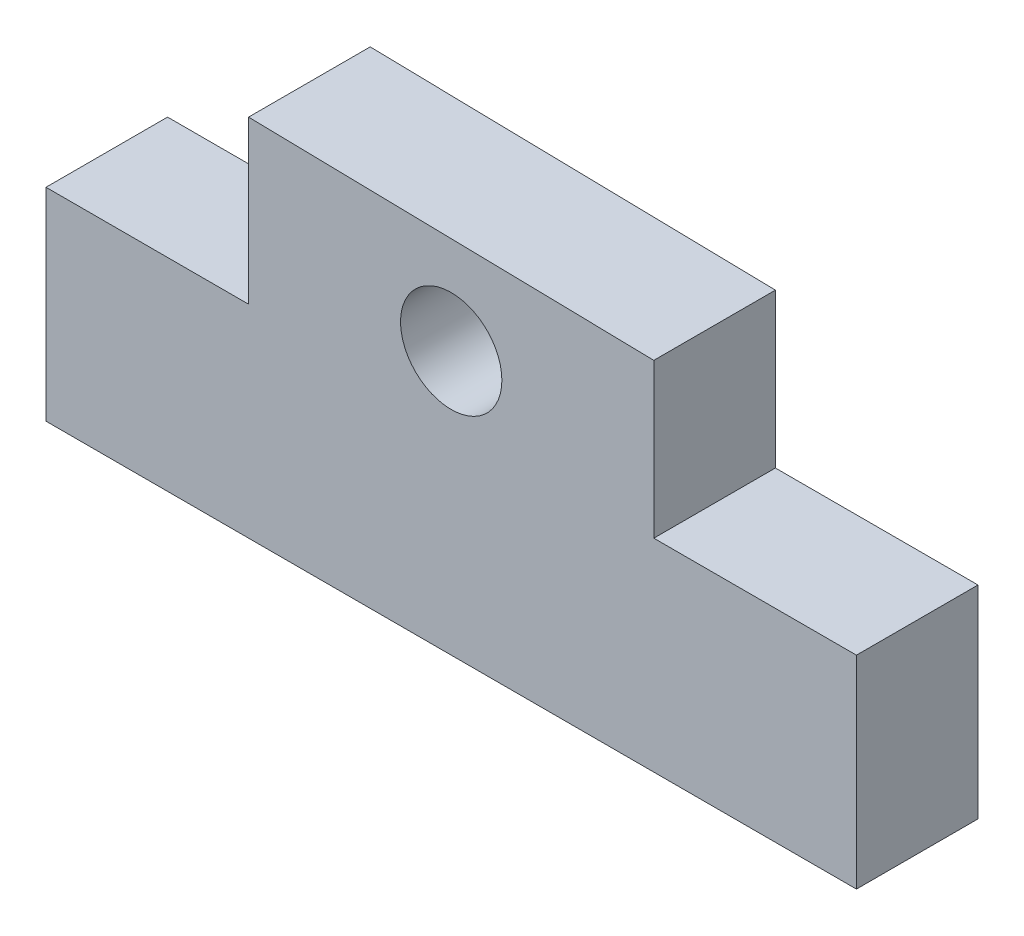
ISO-10303-21;
HEADER;
FILE_DESCRIPTION(('STEP AP214'),'2;1');
FILE_NAME('part.step','',(''),(''),'','','');
FILE_SCHEMA(('AUTOMOTIVE_DESIGN { 1 0 10303 214 1 1 1 1 }'));
ENDSEC;
DATA;
#1=APPLICATION_CONTEXT('core data for automotive mechanical design processes');
#2=APPLICATION_PROTOCOL_DEFINITION('international standard','automotive_design',2000,#1);
#3=PRODUCT_CONTEXT('',#1,'mechanical');
#4=PRODUCT('Part','Part','',(#3));
#5=PRODUCT_RELATED_PRODUCT_CATEGORY('part','',(#4));
#6=PRODUCT_DEFINITION_FORMATION('','',#4);
#7=PRODUCT_DEFINITION_CONTEXT('part definition',#1,'design');
#8=PRODUCT_DEFINITION('design','',#6,#7);
#9=PRODUCT_DEFINITION_SHAPE('','',#8);
#10=(LENGTH_UNIT() NAMED_UNIT(*) SI_UNIT(.MILLI.,.METRE.));
#11=(NAMED_UNIT(*) PLANE_ANGLE_UNIT() SI_UNIT($,.RADIAN.));
#12=(NAMED_UNIT(*) SI_UNIT($,.STERADIAN.) SOLID_ANGLE_UNIT());
#13=UNCERTAINTY_MEASURE_WITH_UNIT(LENGTH_MEASURE(1.E-05),#10,'distance_accuracy_value','');
#14=(GEOMETRIC_REPRESENTATION_CONTEXT(3) GLOBAL_UNCERTAINTY_ASSIGNED_CONTEXT((#13)) GLOBAL_UNIT_ASSIGNED_CONTEXT((#10,
#11,#12)) REPRESENTATION_CONTEXT('',''));
#15=CARTESIAN_POINT('',(0.,0.,0.));
#16=DIRECTION('',(0.,0.,1.));
#17=DIRECTION('',(1.,0.,0.));
#18=AXIS2_PLACEMENT_3D('',#15,#16,#17);
#19=CARTESIAN_POINT('',(5.72225175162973E-12,257.707308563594,3.));
#20=DIRECTION('',(0.,1.,0.));
#21=DIRECTION('',(-1.,0.,0.));
#22=AXIS2_PLACEMENT_3D('',#19,#20,#21);
#23=PLANE('',#22);
#24=DIRECTION('',(1.,0.,0.));
#25=VECTOR('',#24,1.);
#26=CARTESIAN_POINT('',(5.72225175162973E-12,257.707308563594,0.));
#27=LINE('',#26,#25);
#28=CARTESIAN_POINT('',(60.3873488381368,257.707308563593,0.));
#29=VERTEX_POINT('',#28);
#30=CARTESIAN_POINT('',(65.3873488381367,257.707308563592,0.));
#31=VERTEX_POINT('',#30);
#32=EDGE_CURVE('E129',#29,#31,#27,.T.);
#33=ORIENTED_EDGE('',*,*,#32,.F.);
#34=DIRECTION('',(0.,0.,-1.));
#35=VECTOR('',#34,1.);
#36=CARTESIAN_POINT('',(60.3873488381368,257.707308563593,3.));
#37=LINE('',#36,#35);
#38=CARTESIAN_POINT('',(60.3873488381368,257.707308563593,3.));
#39=VERTEX_POINT('',#38);
#40=EDGE_CURVE('E11',#39,#29,#37,.T.);
#41=ORIENTED_EDGE('',*,*,#40,.F.);
#42=DIRECTION('',(1.,0.,0.));
#43=VECTOR('',#42,1.);
#44=CARTESIAN_POINT('',(5.72225175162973E-12,257.707308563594,3.));
#45=LINE('',#44,#43);
#46=CARTESIAN_POINT('',(65.3873488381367,257.707308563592,3.));
#47=VERTEX_POINT('',#46);
#48=EDGE_CURVE('E178',#39,#47,#45,.T.);
#49=ORIENTED_EDGE('',*,*,#48,.T.);
#50=DIRECTION('',(0.,0.,-1.));
#51=VECTOR('',#50,1.);
#52=CARTESIAN_POINT('',(65.3873488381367,257.707308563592,3.));
#53=LINE('',#52,#51);
#54=EDGE_CURVE('E83',#47,#31,#53,.T.);
#55=ORIENTED_EDGE('',*,*,#54,.T.);
#56=EDGE_LOOP('',(#33,#41,#49,#55));
#57=FACE_BOUND('',#56,.T.);
#58=ADVANCED_FACE('F32',(#57),#23,.T.);
#59=CARTESIAN_POINT('',(60.3873488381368,0.,3.));
#60=DIRECTION('',(1.,0.,0.));
#61=DIRECTION('',(0.,0.,-1.));
#62=AXIS2_PLACEMENT_3D('',#59,#60,#61);
#63=PLANE('',#62);
#64=DIRECTION('',(0.,-1.,0.));
#65=VECTOR('',#64,1.);
#66=CARTESIAN_POINT('',(60.3873488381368,0.,0.));
#67=LINE('',#66,#65);
#68=CARTESIAN_POINT('',(60.3873488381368,261.508801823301,0.));
#69=VERTEX_POINT('',#68);
#70=EDGE_CURVE('E132',#69,#29,#67,.T.);
#71=ORIENTED_EDGE('',*,*,#70,.F.);
#72=DIRECTION('',(0.,0.,-1.));
#73=VECTOR('',#72,1.);
#74=CARTESIAN_POINT('',(60.3873488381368,261.508801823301,3.));
#75=LINE('',#74,#73);
#76=CARTESIAN_POINT('',(60.3873488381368,261.508801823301,3.));
#77=VERTEX_POINT('',#76);
#78=EDGE_CURVE('E41',#77,#69,#75,.T.);
#79=ORIENTED_EDGE('',*,*,#78,.F.);
#80=DIRECTION('',(0.,-1.,0.));
#81=VECTOR('',#80,1.);
#82=CARTESIAN_POINT('',(60.3873488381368,0.,3.));
#83=LINE('',#82,#81);
#84=EDGE_CURVE('E175',#77,#39,#83,.T.);
#85=ORIENTED_EDGE('',*,*,#84,.T.);
#86=ORIENTED_EDGE('',*,*,#40,.T.);
#87=EDGE_LOOP('',(#71,#79,#85,#86));
#88=FACE_BOUND('',#87,.T.);
#89=ADVANCED_FACE('F166',(#88),#63,.T.);
#90=CARTESIAN_POINT('',(5.21286744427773,262.604052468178,3.));
#91=DIRECTION('',(0.0198467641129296,0.999803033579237,0.));
#92=DIRECTION('',(-0.999803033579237,0.0198467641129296,0.));
#93=AXIS2_PLACEMENT_3D('',#90,#91,#92);
#94=PLANE('',#93);
#95=DIRECTION('',(0.999803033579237,-0.0198467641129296,0.));
#96=VECTOR('',#95,1.);
#97=CARTESIAN_POINT('',(5.21286744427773,262.604052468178,0.));
#98=LINE('',#97,#96);
#99=CARTESIAN_POINT('',(50.3873488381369,261.707308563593,0.));
#100=VERTEX_POINT('',#99);
#101=EDGE_CURVE('E135',#100,#69,#98,.T.);
#102=ORIENTED_EDGE('',*,*,#101,.F.);
#103=DIRECTION('',(0.,0.,-1.));
#104=VECTOR('',#103,1.);
#105=CARTESIAN_POINT('',(50.3873488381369,261.707308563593,3.));
#106=LINE('',#105,#104);
#107=CARTESIAN_POINT('',(50.3873488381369,261.707308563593,3.));
#108=VERTEX_POINT('',#107);
#109=EDGE_CURVE('E155',#108,#100,#106,.T.);
#110=ORIENTED_EDGE('',*,*,#109,.F.);
#111=DIRECTION('',(0.999803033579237,-0.0198467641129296,0.));
#112=VECTOR('',#111,1.);
#113=CARTESIAN_POINT('',(5.21286744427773,262.604052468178,3.));
#114=LINE('',#113,#112);
#115=EDGE_CURVE('E162',#108,#77,#114,.T.);
#116=ORIENTED_EDGE('',*,*,#115,.T.);
#117=ORIENTED_EDGE('',*,*,#78,.T.);
#118=EDGE_LOOP('',(#102,#110,#116,#117));
#119=FACE_BOUND('',#118,.T.);
#120=ADVANCED_FACE('F160',(#119),#94,.T.);
#121=CARTESIAN_POINT('',(50.3873488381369,0.,3.));
#122=DIRECTION('',(-1.,0.,0.));
#123=DIRECTION('',(0.,0.,1.));
#124=AXIS2_PLACEMENT_3D('',#121,#122,#123);
#125=PLANE('',#124);
#126=DIRECTION('',(0.,1.,0.));
#127=VECTOR('',#126,1.);
#128=CARTESIAN_POINT('',(50.3873488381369,0.,0.));
#129=LINE('',#128,#127);
#130=CARTESIAN_POINT('',(50.3873488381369,257.707308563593,0.));
#131=VERTEX_POINT('',#130);
#132=EDGE_CURVE('E138',#131,#100,#129,.T.);
#133=ORIENTED_EDGE('',*,*,#132,.F.);
#134=DIRECTION('',(0.,0.,-1.));
#135=VECTOR('',#134,1.);
#136=CARTESIAN_POINT('',(50.3873488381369,257.707308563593,3.));
#137=LINE('',#136,#135);
#138=CARTESIAN_POINT('',(50.3873488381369,257.707308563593,3.));
#139=VERTEX_POINT('',#138);
#140=EDGE_CURVE('E153',#139,#131,#137,.T.);
#141=ORIENTED_EDGE('',*,*,#140,.F.);
#142=DIRECTION('',(0.,1.,0.));
#143=VECTOR('',#142,1.);
#144=CARTESIAN_POINT('',(50.3873488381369,0.,3.));
#145=LINE('',#144,#143);
#146=EDGE_CURVE('E174',#139,#108,#145,.T.);
#147=ORIENTED_EDGE('',*,*,#146,.T.);
#148=ORIENTED_EDGE('',*,*,#109,.T.);
#149=EDGE_LOOP('',(#133,#141,#147,#148));
#150=FACE_BOUND('',#149,.T.);
#151=ADVANCED_FACE('F172',(#150),#125,.T.);
#152=CARTESIAN_POINT('',(0.,257.707308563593,3.));
#153=DIRECTION('',(0.,1.,0.));
#154=DIRECTION('',(0.,0.,1.));
#155=AXIS2_PLACEMENT_3D('',#152,#153,#154);
#156=PLANE('',#155);
#157=DIRECTION('',(1.,0.,0.));
#158=VECTOR('',#157,1.);
#159=CARTESIAN_POINT('',(0.,257.707308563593,0.));
#160=LINE('',#159,#158);
#161=CARTESIAN_POINT('',(45.3873488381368,257.707308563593,0.));
#162=VERTEX_POINT('',#161);
#163=EDGE_CURVE('E141',#162,#131,#160,.T.);
#164=ORIENTED_EDGE('',*,*,#163,.F.);
#165=DIRECTION('',(0.,0.,-1.));
#166=VECTOR('',#165,1.);
#167=CARTESIAN_POINT('',(45.3873488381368,257.707308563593,3.));
#168=LINE('',#167,#166);
#169=CARTESIAN_POINT('',(45.3873488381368,257.707308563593,3.));
#170=VERTEX_POINT('',#169);
#171=EDGE_CURVE('E112',#170,#162,#168,.T.);
#172=ORIENTED_EDGE('',*,*,#171,.F.);
#173=DIRECTION('',(1.,0.,0.));
#174=VECTOR('',#173,1.);
#175=CARTESIAN_POINT('',(0.,257.707308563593,3.));
#176=LINE('',#175,#174);
#177=EDGE_CURVE('E119',#170,#139,#176,.T.);
#178=ORIENTED_EDGE('',*,*,#177,.T.);
#179=ORIENTED_EDGE('',*,*,#140,.T.);
#180=EDGE_LOOP('',(#164,#172,#178,#179));
#181=FACE_BOUND('',#180,.T.);
#182=ADVANCED_FACE('F182',(#181),#156,.T.);
#183=CARTESIAN_POINT('',(45.3873488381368,0.,3.));
#184=DIRECTION('',(-1.,0.,0.));
#185=DIRECTION('',(0.,0.,1.));
#186=AXIS2_PLACEMENT_3D('',#183,#184,#185);
#187=PLANE('',#186);
#188=DIRECTION('',(0.,1.,0.));
#189=VECTOR('',#188,1.);
#190=CARTESIAN_POINT('',(45.3873488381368,0.,0.));
#191=LINE('',#190,#189);
#192=CARTESIAN_POINT('',(45.3873488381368,252.707308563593,0.));
#193=VERTEX_POINT('',#192);
#194=EDGE_CURVE('E107',#193,#162,#191,.T.);
#195=ORIENTED_EDGE('',*,*,#194,.F.);
#196=DIRECTION('',(0.,0.,-1.));
#197=VECTOR('',#196,1.);
#198=CARTESIAN_POINT('',(45.3873488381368,252.707308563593,3.));
#199=LINE('',#198,#197);
#200=CARTESIAN_POINT('',(45.3873488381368,252.707308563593,3.));
#201=VERTEX_POINT('',#200);
#202=EDGE_CURVE('E102',#201,#193,#199,.T.);
#203=ORIENTED_EDGE('',*,*,#202,.F.);
#204=DIRECTION('',(0.,1.,0.));
#205=VECTOR('',#204,1.);
#206=CARTESIAN_POINT('',(45.3873488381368,0.,3.));
#207=LINE('',#206,#205);
#208=EDGE_CURVE('E105',#201,#170,#207,.T.);
#209=ORIENTED_EDGE('',*,*,#208,.T.);
#210=ORIENTED_EDGE('',*,*,#171,.T.);
#211=EDGE_LOOP('',(#195,#203,#209,#210));
#212=FACE_BOUND('',#211,.T.);
#213=ADVANCED_FACE('F104',(#212),#187,.T.);
#214=CARTESIAN_POINT('',(0.,252.707308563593,3.));
#215=DIRECTION('',(0.,-1.,0.));
#216=DIRECTION('',(0.,0.,-1.));
#217=AXIS2_PLACEMENT_3D('',#214,#215,#216);
#218=PLANE('',#217);
#219=DIRECTION('',(-1.,0.,0.));
#220=VECTOR('',#219,1.);
#221=CARTESIAN_POINT('',(0.,252.707308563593,0.));
#222=LINE('',#221,#220);
#223=CARTESIAN_POINT('',(65.3873488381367,252.707308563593,0.));
#224=VERTEX_POINT('',#223);
#225=EDGE_CURVE('E145',#224,#193,#222,.T.);
#226=ORIENTED_EDGE('',*,*,#225,.F.);
#227=DIRECTION('',(0.,0.,-1.));
#228=VECTOR('',#227,1.);
#229=CARTESIAN_POINT('',(65.3873488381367,252.707308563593,3.));
#230=LINE('',#229,#228);
#231=CARTESIAN_POINT('',(65.3873488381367,252.707308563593,3.));
#232=VERTEX_POINT('',#231);
#233=EDGE_CURVE('E76',#232,#224,#230,.T.);
#234=ORIENTED_EDGE('',*,*,#233,.F.);
#235=DIRECTION('',(-1.,0.,0.));
#236=VECTOR('',#235,1.);
#237=CARTESIAN_POINT('',(0.,252.707308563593,3.));
#238=LINE('',#237,#236);
#239=EDGE_CURVE('E116',#232,#201,#238,.T.);
#240=ORIENTED_EDGE('',*,*,#239,.T.);
#241=ORIENTED_EDGE('',*,*,#202,.T.);
#242=EDGE_LOOP('',(#226,#234,#240,#241));
#243=FACE_BOUND('',#242,.T.);
#244=ADVANCED_FACE('F121',(#243),#218,.T.);
#245=CARTESIAN_POINT('',(55.3873488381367,259.207308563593,3.));
#246=DIRECTION('',(0.,0.,-1.));
#247=DIRECTION('',(-1.,0.,0.));
#248=AXIS2_PLACEMENT_3D('',#245,#246,#247);
#249=CYLINDRICAL_SURFACE('',#248,1.25);
#250=CARTESIAN_POINT('',(55.3873488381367,259.207308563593,3.));
#251=DIRECTION('',(0.,0.,1.));
#252=DIRECTION('',(1.,0.,0.));
#253=AXIS2_PLACEMENT_3D('',#250,#251,#252);
#254=CIRCLE('',#253,1.25);
#255=CARTESIAN_POINT('',(56.6373488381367,259.207308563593,3.));
#256=VERTEX_POINT('',#255);
#257=EDGE_CURVE('E149',#256,#256,#254,.T.);
#258=ORIENTED_EDGE('',*,*,#257,.T.);
#259=EDGE_LOOP('',(#258));
#260=FACE_BOUND('',#259,.T.);
#261=CARTESIAN_POINT('',(55.3873488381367,259.207308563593,0.));
#262=DIRECTION('',(0.,0.,1.));
#263=DIRECTION('',(1.,0.,0.));
#264=AXIS2_PLACEMENT_3D('',#261,#262,#263);
#265=CIRCLE('',#264,1.25);
#266=CARTESIAN_POINT('',(56.6373488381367,259.207308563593,0.));
#267=VERTEX_POINT('',#266);
#268=EDGE_CURVE('E126',#267,#267,#265,.T.);
#269=ORIENTED_EDGE('',*,*,#268,.F.);
#270=EDGE_LOOP('',(#269));
#271=FACE_BOUND('',#270,.T.);
#272=ADVANCED_FACE('F34',(#260,#271),#249,.F.);
#273=CARTESIAN_POINT('',(65.3873488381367,0.,3.));
#274=DIRECTION('',(-1.,0.,0.));
#275=DIRECTION('',(0.,0.,1.));
#276=AXIS2_PLACEMENT_3D('',#273,#274,#275);
#277=PLANE('',#276);
#278=DIRECTION('',(0.,1.,0.));
#279=VECTOR('',#278,1.);
#280=CARTESIAN_POINT('',(65.3873488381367,0.,0.));
#281=LINE('',#280,#279);
#282=EDGE_CURVE('E147',#224,#31,#281,.T.);
#283=ORIENTED_EDGE('',*,*,#282,.T.);
#284=ORIENTED_EDGE('',*,*,#54,.F.);
#285=DIRECTION('',(0.,1.,0.));
#286=VECTOR('',#285,1.);
#287=CARTESIAN_POINT('',(65.3873488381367,0.,3.));
#288=LINE('',#287,#286);
#289=EDGE_CURVE('E49',#232,#47,#288,.T.);
#290=ORIENTED_EDGE('',*,*,#289,.F.);
#291=ORIENTED_EDGE('',*,*,#233,.T.);
#292=EDGE_LOOP('',(#283,#284,#290,#291));
#293=FACE_BOUND('',#292,.T.);
#294=ADVANCED_FACE('F183',(#293),#277,.F.);
#295=CARTESIAN_POINT('',(0.,0.,3.));
#296=DIRECTION('',(0.,0.,1.));
#297=DIRECTION('',(1.,0.,0.));
#298=AXIS2_PLACEMENT_3D('',#295,#296,#297);
#299=PLANE('',#298);
#300=ORIENTED_EDGE('',*,*,#257,.F.);
#301=EDGE_LOOP('',(#300));
#302=FACE_BOUND('',#301,.T.);
#303=ORIENTED_EDGE('',*,*,#48,.F.);
#304=ORIENTED_EDGE('',*,*,#84,.F.);
#305=ORIENTED_EDGE('',*,*,#115,.F.);
#306=ORIENTED_EDGE('',*,*,#146,.F.);
#307=ORIENTED_EDGE('',*,*,#177,.F.);
#308=ORIENTED_EDGE('',*,*,#208,.F.);
#309=ORIENTED_EDGE('',*,*,#239,.F.);
#310=ORIENTED_EDGE('',*,*,#289,.T.);
#311=EDGE_LOOP('',(#303,#304,#305,#306,#307,#308,#309,#310));
#312=FACE_BOUND('',#311,.T.);
#313=ADVANCED_FACE('F115',(#302,#312),#299,.T.);
#314=CARTESIAN_POINT('',(0.,0.,0.));
#315=DIRECTION('',(0.,0.,1.));
#316=DIRECTION('',(1.,0.,0.));
#317=AXIS2_PLACEMENT_3D('',#314,#315,#316);
#318=PLANE('',#317);
#319=ORIENTED_EDGE('',*,*,#268,.T.);
#320=EDGE_LOOP('',(#319));
#321=FACE_BOUND('',#320,.T.);
#322=ORIENTED_EDGE('',*,*,#32,.T.);
#323=ORIENTED_EDGE('',*,*,#282,.F.);
#324=ORIENTED_EDGE('',*,*,#225,.T.);
#325=ORIENTED_EDGE('',*,*,#194,.T.);
#326=ORIENTED_EDGE('',*,*,#163,.T.);
#327=ORIENTED_EDGE('',*,*,#132,.T.);
#328=ORIENTED_EDGE('',*,*,#101,.T.);
#329=ORIENTED_EDGE('',*,*,#70,.T.);
#330=EDGE_LOOP('',(#322,#323,#324,#325,#326,#327,#328,#329));
#331=FACE_BOUND('',#330,.T.);
#332=ADVANCED_FACE('F168',(#321,#331),#318,.F.);
#333=CLOSED_SHELL('',(#58,#89,#120,#151,#182,#213,#244,#272,#294,#313,#332));
#334=MANIFOLD_SOLID_BREP('B2',#333);
#335=ADVANCED_BREP_SHAPE_REPRESENTATION('',(#18,#334),#14);
#336=SHAPE_DEFINITION_REPRESENTATION(#9,#335);
ENDSEC;
END-ISO-10303-21;
